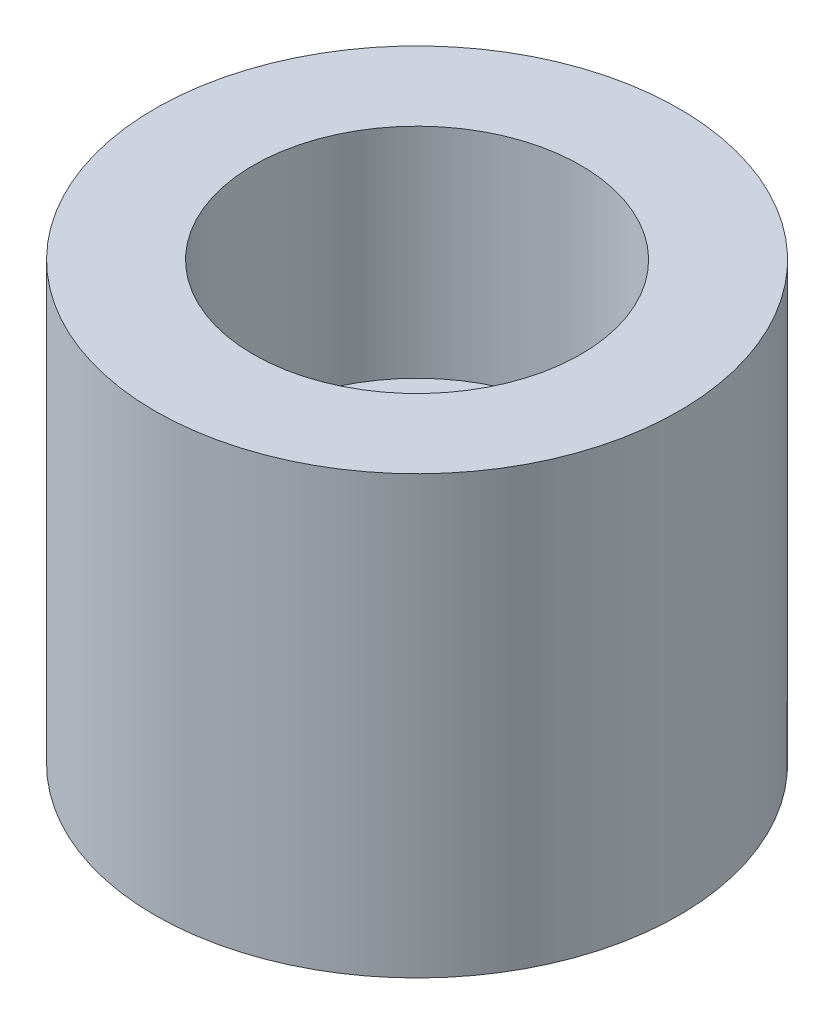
ISO-10303-21;
HEADER;
FILE_DESCRIPTION(('STEP AP214'),'2;1');
FILE_NAME('part.step','',(''),(''),'','','');
FILE_SCHEMA(('AUTOMOTIVE_DESIGN { 1 0 10303 214 1 1 1 1 }'));
ENDSEC;
DATA;
#1=APPLICATION_CONTEXT('core data for automotive mechanical design processes');
#2=APPLICATION_PROTOCOL_DEFINITION('international standard','automotive_design',2000,#1);
#3=PRODUCT_CONTEXT('',#1,'mechanical');
#4=PRODUCT('Part','Part','',(#3));
#5=PRODUCT_RELATED_PRODUCT_CATEGORY('part','',(#4));
#6=PRODUCT_DEFINITION_FORMATION('','',#4);
#7=PRODUCT_DEFINITION_CONTEXT('part definition',#1,'design');
#8=PRODUCT_DEFINITION('design','',#6,#7);
#9=PRODUCT_DEFINITION_SHAPE('','',#8);
#10=(LENGTH_UNIT() NAMED_UNIT(*) SI_UNIT(.MILLI.,.METRE.));
#11=(NAMED_UNIT(*) PLANE_ANGLE_UNIT() SI_UNIT($,.RADIAN.));
#12=(NAMED_UNIT(*) SI_UNIT($,.STERADIAN.) SOLID_ANGLE_UNIT());
#13=UNCERTAINTY_MEASURE_WITH_UNIT(LENGTH_MEASURE(1.E-05),#10,'distance_accuracy_value','');
#14=(GEOMETRIC_REPRESENTATION_CONTEXT(3) GLOBAL_UNCERTAINTY_ASSIGNED_CONTEXT((#13)) GLOBAL_UNIT_ASSIGNED_CONTEXT((#10,
#11,#12)) REPRESENTATION_CONTEXT('',''));
#15=CARTESIAN_POINT('',(0.,0.,0.));
#16=DIRECTION('',(0.,0.,1.));
#17=DIRECTION('',(1.,0.,0.));
#18=AXIS2_PLACEMENT_3D('',#15,#16,#17);
#19=CARTESIAN_POINT('',(0.,100.,0.));
#20=DIRECTION('',(0.,-1.,0.));
#21=DIRECTION('',(0.,0.,-1.));
#22=AXIS2_PLACEMENT_3D('',#19,#20,#21);
#23=CYLINDRICAL_SURFACE('',#22,60.);
#24=CARTESIAN_POINT('',(0.,100.,0.));
#25=DIRECTION('',(0.,1.,0.));
#26=DIRECTION('',(0.,0.,1.));
#27=AXIS2_PLACEMENT_3D('',#24,#25,#26);
#28=CIRCLE('',#27,60.);
#29=CARTESIAN_POINT('',(0.,100.,60.));
#30=VERTEX_POINT('',#29);
#31=EDGE_CURVE('E10',#30,#30,#28,.T.);
#32=ORIENTED_EDGE('',*,*,#31,.F.);
#33=EDGE_LOOP('',(#32));
#34=FACE_BOUND('',#33,.T.);
#35=CARTESIAN_POINT('',(0.,0.,0.));
#36=DIRECTION('',(0.,1.,0.));
#37=DIRECTION('',(0.,0.,1.));
#38=AXIS2_PLACEMENT_3D('',#35,#36,#37);
#39=CIRCLE('',#38,60.);
#40=CARTESIAN_POINT('',(0.,0.,60.));
#41=VERTEX_POINT('',#40);
#42=EDGE_CURVE('E37',#41,#41,#39,.T.);
#43=ORIENTED_EDGE('',*,*,#42,.T.);
#44=EDGE_LOOP('',(#43));
#45=FACE_BOUND('',#44,.T.);
#46=ADVANCED_FACE('F31',(#34,#45),#23,.T.);
#47=CARTESIAN_POINT('',(0.,100.,0.));
#48=DIRECTION('',(0.,1.,0.));
#49=DIRECTION('',(0.,0.,1.));
#50=AXIS2_PLACEMENT_3D('',#47,#48,#49);
#51=PLANE('',#50);
#52=CARTESIAN_POINT('',(0.,100.,0.));
#53=DIRECTION('',(0.,1.,0.));
#54=DIRECTION('',(0.,0.,1.));
#55=AXIS2_PLACEMENT_3D('',#52,#53,#54);
#56=CIRCLE('',#55,37.5);
#57=CARTESIAN_POINT('',(0.,100.,37.5));
#58=VERTEX_POINT('',#57);
#59=EDGE_CURVE('E45',#58,#58,#56,.T.);
#60=ORIENTED_EDGE('',*,*,#59,.F.);
#61=EDGE_LOOP('',(#60));
#62=FACE_BOUND('',#61,.T.);
#63=ORIENTED_EDGE('',*,*,#31,.T.);
#64=EDGE_LOOP('',(#63));
#65=FACE_BOUND('',#64,.T.);
#66=ADVANCED_FACE('F53',(#62,#65),#51,.T.);
#67=CARTESIAN_POINT('',(0.,0.,0.));
#68=DIRECTION('',(0.,1.,0.));
#69=DIRECTION('',(0.,0.,1.));
#70=AXIS2_PLACEMENT_3D('',#67,#68,#69);
#71=PLANE('',#70);
#72=ORIENTED_EDGE('',*,*,#42,.F.);
#73=EDGE_LOOP('',(#72));
#74=FACE_BOUND('',#73,.T.);
#75=ADVANCED_FACE('F55',(#74),#71,.F.);
#76=CARTESIAN_POINT('',(0.,50.,0.));
#77=DIRECTION('',(0.,1.,0.));
#78=DIRECTION('',(0.,0.,1.));
#79=AXIS2_PLACEMENT_3D('',#76,#77,#78);
#80=CYLINDRICAL_SURFACE('',#79,37.5);
#81=CARTESIAN_POINT('',(0.,50.,0.));
#82=DIRECTION('',(0.,1.,0.));
#83=DIRECTION('',(0.,0.,1.));
#84=AXIS2_PLACEMENT_3D('',#81,#82,#83);
#85=CIRCLE('',#84,37.5);
#86=CARTESIAN_POINT('',(0.,50.,37.5));
#87=VERTEX_POINT('',#86);
#88=EDGE_CURVE('E41',#87,#87,#85,.T.);
#89=ORIENTED_EDGE('',*,*,#88,.F.);
#90=EDGE_LOOP('',(#89));
#91=FACE_BOUND('',#90,.T.);
#92=ORIENTED_EDGE('',*,*,#59,.T.);
#93=EDGE_LOOP('',(#92));
#94=FACE_BOUND('',#93,.T.);
#95=ADVANCED_FACE('F51',(#91,#94),#80,.F.);
#96=CARTESIAN_POINT('',(0.,50.,0.));
#97=DIRECTION('',(0.,1.,0.));
#98=DIRECTION('',(0.,0.,1.));
#99=AXIS2_PLACEMENT_3D('',#96,#97,#98);
#100=PLANE('',#99);
#101=ORIENTED_EDGE('',*,*,#88,.T.);
#102=EDGE_LOOP('',(#101));
#103=FACE_BOUND('',#102,.T.);
#104=ADVANCED_FACE('F66',(#103),#100,.T.);
#105=CLOSED_SHELL('',(#46,#66,#75,#95,#104));
#106=MANIFOLD_SOLID_BREP('B2',#105);
#107=ADVANCED_BREP_SHAPE_REPRESENTATION('',(#18,#106),#14);
#108=SHAPE_DEFINITION_REPRESENTATION(#9,#107);
ENDSEC;
END-ISO-10303-21;
